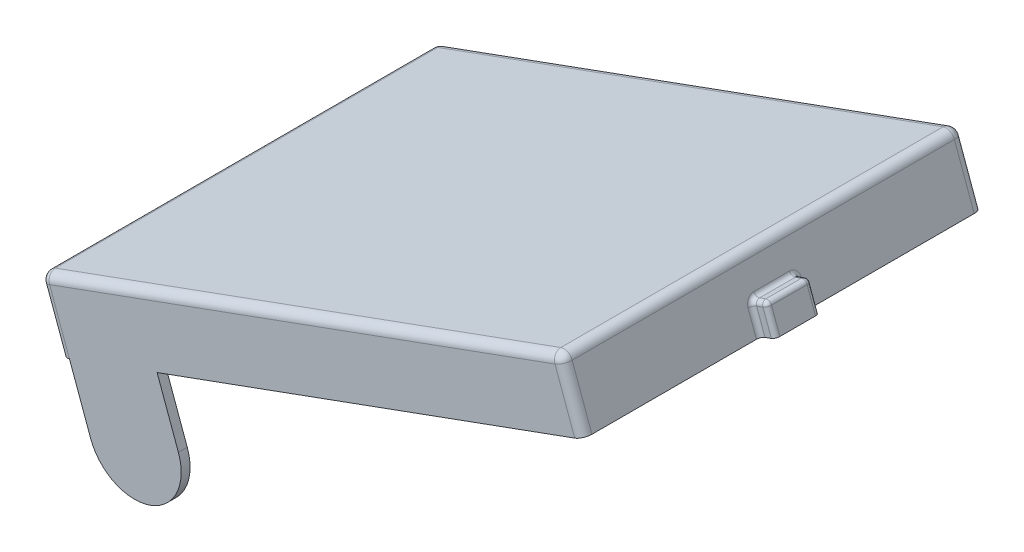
ISO-10303-21;
HEADER;
FILE_DESCRIPTION(('STEP AP214'),'2;1');
FILE_NAME('part.step','',(''),(''),'','','');
FILE_SCHEMA(('AUTOMOTIVE_DESIGN { 1 0 10303 214 1 1 1 1 }'));
ENDSEC;
DATA;
#1=APPLICATION_CONTEXT('core data for automotive mechanical design processes');
#2=APPLICATION_PROTOCOL_DEFINITION('international standard','automotive_design',2000,#1);
#3=PRODUCT_CONTEXT('',#1,'mechanical');
#4=PRODUCT('Part','Part','',(#3));
#5=PRODUCT_RELATED_PRODUCT_CATEGORY('part','',(#4));
#6=PRODUCT_DEFINITION_FORMATION('','',#4);
#7=PRODUCT_DEFINITION_CONTEXT('part definition',#1,'design');
#8=PRODUCT_DEFINITION('design','',#6,#7);
#9=PRODUCT_DEFINITION_SHAPE('','',#8);
#10=(LENGTH_UNIT() NAMED_UNIT(*) SI_UNIT(.MILLI.,.METRE.));
#11=(NAMED_UNIT(*) PLANE_ANGLE_UNIT() SI_UNIT($,.RADIAN.));
#12=(NAMED_UNIT(*) SI_UNIT($,.STERADIAN.) SOLID_ANGLE_UNIT());
#13=UNCERTAINTY_MEASURE_WITH_UNIT(LENGTH_MEASURE(1.E-05),#10,'distance_accuracy_value','');
#14=(GEOMETRIC_REPRESENTATION_CONTEXT(3) GLOBAL_UNCERTAINTY_ASSIGNED_CONTEXT((#13)) GLOBAL_UNIT_ASSIGNED_CONTEXT((#10,
#11,#12)) REPRESENTATION_CONTEXT('',''));
#15=CARTESIAN_POINT('',(0.,0.,0.));
#16=DIRECTION('',(0.,0.,1.));
#17=DIRECTION('',(1.,0.,0.));
#18=AXIS2_PLACEMENT_3D('',#15,#16,#17);
#19=CARTESIAN_POINT('',(45.7968356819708,81.7283521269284,45.));
#20=DIRECTION('',(-0.939692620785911,-0.342020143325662,0.));
#21=DIRECTION('',(0.,0.,1.));
#22=AXIS2_PLACEMENT_3D('',#19,#20,#21);
#23=PLANE('',#22);
#24=CARTESIAN_POINT('',(49.0460270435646,72.8012722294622,-3.99999999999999));
#25=DIRECTION('',(-0.939692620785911,-0.342020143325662,0.));
#26=DIRECTION('',(0.342020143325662,-0.939692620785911,0.));
#27=AXIS2_PLACEMENT_3D('',#24,#25,#26);
#28=CIRCLE('',#27,2.);
#29=CARTESIAN_POINT('',(49.0460270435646,72.8012722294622,-5.99999999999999));
#30=VERTEX_POINT('',#29);
#31=CARTESIAN_POINT('',(48.3619867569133,74.6806574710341,-3.99999999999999));
#32=VERTEX_POINT('',#31);
#33=EDGE_CURVE('E43',#30,#32,#28,.F.);
#34=ORIENTED_EDGE('',*,*,#33,.F.);
#35=DIRECTION('',(-0.342020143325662,0.939692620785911,0.));
#36=VECTOR('',#35,1.);
#37=CARTESIAN_POINT('',(50.9271378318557,67.6329628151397,-5.99999999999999));
#38=LINE('',#37,#36);
#39=CARTESIAN_POINT('',(50.9271378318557,67.6329628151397,-5.99999999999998));
#40=VERTEX_POINT('',#39);
#41=EDGE_CURVE('E354',#30,#40,#38,.F.);
#42=ORIENTED_EDGE('',*,*,#41,.T.);
#43=DIRECTION('',(0.,0.,-1.));
#44=VECTOR('',#43,1.);
#45=CARTESIAN_POINT('',(50.9271378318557,67.6329628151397,45.));
#46=LINE('',#45,#44);
#47=CARTESIAN_POINT('',(50.9271378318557,67.6329628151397,-43.));
#48=VERTEX_POINT('',#47);
#49=EDGE_CURVE('E364',#40,#48,#46,.T.);
#50=ORIENTED_EDGE('',*,*,#49,.T.);
#51=DIRECTION('',(0.342020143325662,-0.939692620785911,0.));
#52=VECTOR('',#51,1.);
#53=CARTESIAN_POINT('',(45.7968356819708,81.7283521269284,-43.));
#54=LINE('',#53,#52);
#55=CARTESIAN_POINT('',(46.4808759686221,79.8489668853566,-43.));
#56=VERTEX_POINT('',#55);
#57=EDGE_CURVE('E504',#48,#56,#54,.F.);
#58=ORIENTED_EDGE('',*,*,#57,.T.);
#59=DIRECTION('',(0.,0.,-1.));
#60=VECTOR('',#59,1.);
#61=CARTESIAN_POINT('',(46.4808759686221,79.8489668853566,43.));
#62=LINE('',#61,#60);
#63=CARTESIAN_POINT('',(46.4808759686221,79.8489668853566,43.));
#64=VERTEX_POINT('',#63);
#65=EDGE_CURVE('E482',#56,#64,#62,.F.);
#66=ORIENTED_EDGE('',*,*,#65,.T.);
#67=DIRECTION('',(0.342020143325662,-0.939692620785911,0.));
#68=VECTOR('',#67,1.);
#69=CARTESIAN_POINT('',(45.7968356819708,81.7283521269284,43.));
#70=LINE('',#69,#68);
#71=CARTESIAN_POINT('',(50.9271378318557,67.6329628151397,43.));
#72=VERTEX_POINT('',#71);
#73=EDGE_CURVE('E507',#64,#72,#70,.T.);
#74=ORIENTED_EDGE('',*,*,#73,.T.);
#75=CARTESIAN_POINT('',(50.9271378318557,67.6329628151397,6.00000000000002));
#76=VERTEX_POINT('',#75);
#77=EDGE_CURVE('E532',#72,#76,#46,.T.);
#78=ORIENTED_EDGE('',*,*,#77,.T.);
#79=DIRECTION('',(0.342020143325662,-0.939692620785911,0.));
#80=VECTOR('',#79,1.);
#81=CARTESIAN_POINT('',(48.7040069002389,73.7409648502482,6.00000000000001));
#82=LINE('',#81,#80);
#83=CARTESIAN_POINT('',(49.0460270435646,72.8012722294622,6.00000000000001));
#84=VERTEX_POINT('',#83);
#85=EDGE_CURVE('E350',#76,#84,#82,.F.);
#86=ORIENTED_EDGE('',*,*,#85,.T.);
#87=CARTESIAN_POINT('',(49.0460270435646,72.8012722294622,4.00000000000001));
#88=DIRECTION('',(-0.939692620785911,-0.342020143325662,0.));
#89=DIRECTION('',(0.342020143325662,-0.939692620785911,0.));
#90=AXIS2_PLACEMENT_3D('',#87,#88,#89);
#91=CIRCLE('',#90,2.);
#92=CARTESIAN_POINT('',(48.3619867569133,74.6806574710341,4.00000000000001));
#93=VERTEX_POINT('',#92);
#94=EDGE_CURVE('E347',#93,#84,#91,.F.);
#95=ORIENTED_EDGE('',*,*,#94,.F.);
#96=DIRECTION('',(0.,0.,1.));
#97=VECTOR('',#96,1.);
#98=CARTESIAN_POINT('',(48.3619867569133,74.6806574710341,-4.99999999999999));
#99=LINE('',#98,#97);
#100=EDGE_CURVE('E48',#93,#32,#99,.F.);
#101=ORIENTED_EDGE('',*,*,#100,.T.);
#102=EDGE_LOOP('',(#34,#42,#50,#58,#66,#74,#78,#86,#95,#101));
#103=FACE_BOUND('',#102,.T.);
#104=ADVANCED_FACE('F28',(#103),#23,.F.);
#105=CARTESIAN_POINT('',(50.9271378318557,67.6329628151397,-45.));
#106=DIRECTION('',(-0.342020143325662,0.939692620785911,0.));
#107=DIRECTION('',(0.,0.,1.));
#108=AXIS2_PLACEMENT_3D('',#105,#106,#107);
#109=PLANE('',#108);
#110=DIRECTION('',(0.,0.,-1.));
#111=VECTOR('',#110,1.);
#112=CARTESIAN_POINT('',(-64.6550545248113,25.5644851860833,-43.));
#113=LINE('',#112,#111);
#114=CARTESIAN_POINT('',(-64.6550545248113,25.5644851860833,-43.));
#115=VERTEX_POINT('',#114);
#116=CARTESIAN_POINT('',(-64.6550545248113,25.5644851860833,-45.));
#117=VERTEX_POINT('',#116);
#118=EDGE_CURVE('E269',#115,#117,#113,.T.);
#119=ORIENTED_EDGE('',*,*,#118,.F.);
#120=DIRECTION('',(0.,0.,1.));
#121=VECTOR('',#120,1.);
#122=CARTESIAN_POINT('',(-64.6550545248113,25.5644851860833,45.));
#123=LINE('',#122,#121);
#124=CARTESIAN_POINT('',(-64.6550545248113,25.5644851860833,43.));
#125=VERTEX_POINT('',#124);
#126=EDGE_CURVE('E457',#115,#125,#123,.T.);
#127=ORIENTED_EDGE('',*,*,#126,.T.);
#128=DIRECTION('',(0.,0.,1.));
#129=VECTOR('',#128,1.);
#130=CARTESIAN_POINT('',(-64.6550545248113,25.5644851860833,43.));
#131=LINE('',#130,#129);
#132=CARTESIAN_POINT('',(-64.6550545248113,25.5644851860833,45.));
#133=VERTEX_POINT('',#132);
#134=EDGE_CURVE('E307',#125,#133,#131,.T.);
#135=ORIENTED_EDGE('',*,*,#134,.T.);
#136=CARTESIAN_POINT('',(-64.6550545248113,25.5644851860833,43.));
#137=DIRECTION('',(-0.342020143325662,0.939692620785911,0.));
#138=DIRECTION('',(0.,0.,1.));
#139=AXIS2_PLACEMENT_3D('',#136,#137,#138);
#140=CIRCLE('',#139,2.);
#141=CARTESIAN_POINT('',(-66.5344397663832,24.880444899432,43.));
#142=VERTEX_POINT('',#141);
#143=EDGE_CURVE('E520',#133,#142,#140,.F.);
#144=ORIENTED_EDGE('',*,*,#143,.T.);
#145=DIRECTION('',(0.,0.,1.));
#146=VECTOR('',#145,1.);
#147=CARTESIAN_POINT('',(-66.5344397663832,24.880444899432,45.));
#148=LINE('',#147,#146);
#149=CARTESIAN_POINT('',(-66.5344397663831,24.880444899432,-43.));
#150=VERTEX_POINT('',#149);
#151=EDGE_CURVE('E536',#150,#142,#148,.T.);
#152=ORIENTED_EDGE('',*,*,#151,.F.);
#153=CARTESIAN_POINT('',(-64.6550545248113,25.5644851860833,-43.));
#154=DIRECTION('',(-0.342020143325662,0.939692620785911,0.));
#155=DIRECTION('',(0.,0.,1.));
#156=AXIS2_PLACEMENT_3D('',#153,#154,#155);
#157=CIRCLE('',#156,2.);
#158=EDGE_CURVE('E460',#150,#117,#157,.F.);
#159=ORIENTED_EDGE('',*,*,#158,.T.);
#160=EDGE_LOOP('',(#119,#127,#135,#144,#152,#159));
#161=FACE_BOUND('',#160,.T.);
#162=ADVANCED_FACE('F455',(#161),#109,.F.);
#163=DIRECTION('',(-0.939692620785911,-0.342020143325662,0.));
#164=VECTOR('',#163,1.);
#165=CARTESIAN_POINT('',(54.2160620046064,68.8300333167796,-4.99999999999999));
#166=LINE('',#165,#164);
#167=CARTESIAN_POINT('',(53.2763693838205,68.4880131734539,-4.99999999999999));
#168=VERTEX_POINT('',#167);
#169=CARTESIAN_POINT('',(51.8668304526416,67.9749829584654,-4.99999999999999));
#170=VERTEX_POINT('',#169);
#171=EDGE_CURVE('E361',#168,#170,#166,.T.);
#172=ORIENTED_EDGE('',*,*,#171,.F.);
#173=CARTESIAN_POINT('',(53.2763693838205,68.4880131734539,-3.99999999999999));
#174=DIRECTION('',(-0.342020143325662,0.939692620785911,0.));
#175=DIRECTION('',(-0.939692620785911,-0.342020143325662,0.));
#176=AXIS2_PLACEMENT_3D('',#173,#174,#175);
#177=CIRCLE('',#176,1.);
#178=CARTESIAN_POINT('',(54.2160620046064,68.8300333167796,-3.99999999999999));
#179=VERTEX_POINT('',#178);
#180=EDGE_CURVE('E330',#168,#179,#177,.F.);
#181=ORIENTED_EDGE('',*,*,#180,.T.);
#182=DIRECTION('',(0.,0.,-1.));
#183=VECTOR('',#182,1.);
#184=CARTESIAN_POINT('',(54.2160620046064,68.8300333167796,5.00000000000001));
#185=LINE('',#184,#183);
#186=CARTESIAN_POINT('',(54.2160620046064,68.8300333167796,4.00000000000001));
#187=VERTEX_POINT('',#186);
#188=EDGE_CURVE('E372',#187,#179,#185,.T.);
#189=ORIENTED_EDGE('',*,*,#188,.F.);
#190=CARTESIAN_POINT('',(53.2763693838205,68.4880131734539,4.00000000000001));
#191=DIRECTION('',(-0.342020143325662,0.939692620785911,0.));
#192=DIRECTION('',(-0.939692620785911,-0.342020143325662,0.));
#193=AXIS2_PLACEMENT_3D('',#190,#191,#192);
#194=CIRCLE('',#193,1.);
#195=CARTESIAN_POINT('',(53.2763693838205,68.4880131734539,5.00000000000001));
#196=VERTEX_POINT('',#195);
#197=EDGE_CURVE('E328',#187,#196,#194,.F.);
#198=ORIENTED_EDGE('',*,*,#197,.T.);
#199=DIRECTION('',(-0.939692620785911,-0.342020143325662,0.));
#200=VECTOR('',#199,1.);
#201=CARTESIAN_POINT('',(54.2160620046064,68.8300333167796,5.00000000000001));
#202=LINE('',#201,#200);
#203=CARTESIAN_POINT('',(51.8668304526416,67.9749829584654,5.00000000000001));
#204=VERTEX_POINT('',#203);
#205=EDGE_CURVE('E371',#196,#204,#202,.T.);
#206=ORIENTED_EDGE('',*,*,#205,.T.);
#207=CARTESIAN_POINT('',(51.8668304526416,67.9749829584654,6.00000000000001));
#208=DIRECTION('',(-0.342020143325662,0.939692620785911,0.));
#209=DIRECTION('',(-0.939692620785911,-0.342020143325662,0.));
#210=AXIS2_PLACEMENT_3D('',#207,#208,#209);
#211=CIRCLE('',#210,1.);
#212=EDGE_CURVE('E11',#204,#76,#211,.T.);
#213=ORIENTED_EDGE('',*,*,#212,.T.);
#214=ORIENTED_EDGE('',*,*,#77,.F.);
#215=CARTESIAN_POINT('',(49.0477525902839,66.9489225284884,43.));
#216=DIRECTION('',(-0.342020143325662,0.939692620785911,0.));
#217=DIRECTION('',(0.,0.,1.));
#218=AXIS2_PLACEMENT_3D('',#215,#216,#217);
#219=CIRCLE('',#218,2.);
#220=CARTESIAN_POINT('',(49.0477525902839,66.9489225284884,45.));
#221=VERTEX_POINT('',#220);
#222=EDGE_CURVE('E524',#72,#221,#219,.F.);
#223=ORIENTED_EDGE('',*,*,#222,.T.);
#224=DIRECTION('',(0.939692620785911,0.342020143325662,0.));
#225=VECTOR('',#224,1.);
#226=CARTESIAN_POINT('',(-66.5344397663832,24.880444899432,45.));
#227=LINE('',#226,#225);
#228=CARTESIAN_POINT('',(-44.9215094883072,32.7469081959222,45.));
#229=VERTEX_POINT('',#228);
#230=EDGE_CURVE('E303',#229,#221,#227,.T.);
#231=ORIENTED_EDGE('',*,*,#230,.F.);
#232=DIRECTION('',(0.,0.,1.));
#233=VECTOR('',#232,1.);
#234=CARTESIAN_POINT('',(-44.9215094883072,32.7469081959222,43.));
#235=LINE('',#234,#233);
#236=CARTESIAN_POINT('',(-44.9215094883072,32.7469081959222,43.));
#237=VERTEX_POINT('',#236);
#238=EDGE_CURVE('E299',#237,#229,#235,.T.);
#239=ORIENTED_EDGE('',*,*,#238,.F.);
#240=DIRECTION('',(0.939692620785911,0.342020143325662,0.));
#241=VECTOR('',#240,1.);
#242=CARTESIAN_POINT('',(-66.5344397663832,24.880444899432,43.));
#243=LINE('',#242,#241);
#244=CARTESIAN_POINT('',(49.0477525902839,66.9489225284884,43.));
#245=VERTEX_POINT('',#244);
#246=EDGE_CURVE('E469',#237,#245,#243,.T.);
#247=ORIENTED_EDGE('',*,*,#246,.T.);
#248=DIRECTION('',(0.,0.,-1.));
#249=VECTOR('',#248,1.);
#250=CARTESIAN_POINT('',(49.0477525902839,66.9489225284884,45.));
#251=LINE('',#250,#249);
#252=CARTESIAN_POINT('',(49.0477525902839,66.9489225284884,-43.));
#253=VERTEX_POINT('',#252);
#254=EDGE_CURVE('E467',#245,#253,#251,.T.);
#255=ORIENTED_EDGE('',*,*,#254,.T.);
#256=DIRECTION('',(-0.939692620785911,-0.342020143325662,0.));
#257=VECTOR('',#256,1.);
#258=CARTESIAN_POINT('',(-66.5344397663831,24.880444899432,-43.));
#259=LINE('',#258,#257);
#260=CARTESIAN_POINT('',(-44.9215094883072,32.7469081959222,-43.));
#261=VERTEX_POINT('',#260);
#262=EDGE_CURVE('E302',#253,#261,#259,.T.);
#263=ORIENTED_EDGE('',*,*,#262,.T.);
#264=DIRECTION('',(0.,0.,-1.));
#265=VECTOR('',#264,1.);
#266=CARTESIAN_POINT('',(-44.9215094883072,32.7469081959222,-43.));
#267=LINE('',#266,#265);
#268=CARTESIAN_POINT('',(-44.9215094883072,32.7469081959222,-45.));
#269=VERTEX_POINT('',#268);
#270=EDGE_CURVE('E250',#261,#269,#267,.T.);
#271=ORIENTED_EDGE('',*,*,#270,.T.);
#272=DIRECTION('',(-0.939692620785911,-0.342020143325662,0.));
#273=VECTOR('',#272,1.);
#274=CARTESIAN_POINT('',(-66.5344397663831,24.880444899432,-45.));
#275=LINE('',#274,#273);
#276=CARTESIAN_POINT('',(49.0477525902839,66.9489225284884,-45.));
#277=VERTEX_POINT('',#276);
#278=EDGE_CURVE('E255',#277,#269,#275,.T.);
#279=ORIENTED_EDGE('',*,*,#278,.F.);
#280=CARTESIAN_POINT('',(49.0477525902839,66.9489225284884,-43.));
#281=DIRECTION('',(-0.342020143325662,0.939692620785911,0.));
#282=DIRECTION('',(0.,0.,1.));
#283=AXIS2_PLACEMENT_3D('',#280,#281,#282);
#284=CIRCLE('',#283,2.);
#285=EDGE_CURVE('E522',#277,#48,#284,.F.);
#286=ORIENTED_EDGE('',*,*,#285,.T.);
#287=ORIENTED_EDGE('',*,*,#49,.F.);
#288=CARTESIAN_POINT('',(51.8668304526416,67.9749829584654,-5.99999999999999));
#289=DIRECTION('',(-0.342020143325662,0.939692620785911,0.));
#290=DIRECTION('',(-0.939692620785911,-0.342020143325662,0.));
#291=AXIS2_PLACEMENT_3D('',#288,#289,#290);
#292=CIRCLE('',#291,1.);
#293=EDGE_CURVE('E36',#40,#170,#292,.T.);
#294=ORIENTED_EDGE('',*,*,#293,.T.);
#295=EDGE_LOOP('',(#172,#181,#189,#198,#206,#213,#214,#223,#231,#239,#247,#255,#263,#271,#279,
#286,#287,#294));
#296=FACE_BOUND('',#295,.T.);
#297=ADVANCED_FACE('F360',(#296),#109,.F.);
#298=CARTESIAN_POINT('',(-71.6647419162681,38.9758342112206,-45.));
#299=DIRECTION('',(0.,0.,1.));
#300=DIRECTION('',(0.939692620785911,0.342020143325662,0.));
#301=AXIS2_PLACEMENT_3D('',#298,#299,#300);
#302=PLANE('',#301);
#303=DIRECTION('',(0.342020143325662,-0.939692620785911,0.));
#304=VECTOR('',#303,1.);
#305=CARTESIAN_POINT('',(-69.7853566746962,39.659874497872,-45.));
#306=LINE('',#305,#304);
#307=CARTESIAN_POINT('',(-69.1013163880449,37.7804892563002,-45.));
#308=VERTEX_POINT('',#307);
#309=EDGE_CURVE('E515',#117,#308,#306,.F.);
#310=ORIENTED_EDGE('',*,*,#309,.T.);
#311=DIRECTION('',(-0.939692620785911,-0.342020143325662,0.));
#312=VECTOR('',#311,1.);
#313=CARTESIAN_POINT('',(44.6014907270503,79.1649265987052,-45.));
#314=LINE('',#313,#312);
#315=CARTESIAN_POINT('',(44.6014907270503,79.1649265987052,-45.));
#316=VERTEX_POINT('',#315);
#317=EDGE_CURVE('E486',#308,#316,#314,.F.);
#318=ORIENTED_EDGE('',*,*,#317,.T.);
#319=DIRECTION('',(0.342020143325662,-0.939692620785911,0.));
#320=VECTOR('',#319,1.);
#321=CARTESIAN_POINT('',(43.917450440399,81.0443118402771,-45.));
#322=LINE('',#321,#320);
#323=EDGE_CURVE('E517',#316,#277,#322,.T.);
#324=ORIENTED_EDGE('',*,*,#323,.T.);
#325=ORIENTED_EDGE('',*,*,#278,.T.);
#326=DIRECTION('',(-0.342020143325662,0.939692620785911,0.));
#327=VECTOR('',#326,1.);
#328=CARTESIAN_POINT('',(-40.1332274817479,19.5912115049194,-45.));
#329=LINE('',#328,#327);
#330=CARTESIAN_POINT('',(-40.1332274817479,19.5912115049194,-45.));
#331=VERTEX_POINT('',#330);
#332=EDGE_CURVE('E242',#331,#269,#329,.T.);
#333=ORIENTED_EDGE('',*,*,#332,.F.);
#334=CARTESIAN_POINT('',(-50.,16.,-45.));
#335=DIRECTION('',(0.,0.,1.));
#336=DIRECTION('',(0.939692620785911,0.342020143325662,0.));
#337=AXIS2_PLACEMENT_3D('',#334,#335,#336);
#338=CIRCLE('',#337,10.5);
#339=CARTESIAN_POINT('',(-59.8667725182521,12.4087884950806,-45.));
#340=VERTEX_POINT('',#339);
#341=EDGE_CURVE('E230',#340,#331,#338,.T.);
#342=ORIENTED_EDGE('',*,*,#341,.F.);
#343=DIRECTION('',(0.342020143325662,-0.939692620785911,0.));
#344=VECTOR('',#343,1.);
#345=CARTESIAN_POINT('',(-64.6550545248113,25.5644851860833,-45.));
#346=LINE('',#345,#344);
#347=EDGE_CURVE('E241',#117,#340,#346,.T.);
#348=ORIENTED_EDGE('',*,*,#347,.F.);
#349=EDGE_LOOP('',(#310,#318,#324,#325,#333,#342,#348));
#350=FACE_BOUND('',#349,.T.);
#351=ADVANCED_FACE('F30',(#350),#302,.F.);
#352=CARTESIAN_POINT('',(-71.6647419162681,38.9758342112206,45.));
#353=DIRECTION('',(0.939692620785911,0.342020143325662,0.));
#354=DIRECTION('',(0.,0.,-1.));
#355=AXIS2_PLACEMENT_3D('',#352,#353,#354);
#356=PLANE('',#355);
#357=DIRECTION('',(0.342020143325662,-0.939692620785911,0.));
#358=VECTOR('',#357,1.);
#359=CARTESIAN_POINT('',(-71.6647419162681,38.9758342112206,43.));
#360=LINE('',#359,#358);
#361=CARTESIAN_POINT('',(-70.9807016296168,37.0964489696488,43.));
#362=VERTEX_POINT('',#361);
#363=EDGE_CURVE('E529',#142,#362,#360,.F.);
#364=ORIENTED_EDGE('',*,*,#363,.T.);
#365=DIRECTION('',(0.,0.,1.));
#366=VECTOR('',#365,1.);
#367=CARTESIAN_POINT('',(-70.9807016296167,37.0964489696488,-43.));
#368=LINE('',#367,#366);
#369=CARTESIAN_POINT('',(-70.9807016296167,37.0964489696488,-43.));
#370=VERTEX_POINT('',#369);
#371=EDGE_CURVE('E490',#362,#370,#368,.F.);
#372=ORIENTED_EDGE('',*,*,#371,.T.);
#373=DIRECTION('',(0.342020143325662,-0.939692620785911,0.));
#374=VECTOR('',#373,1.);
#375=CARTESIAN_POINT('',(-71.6647419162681,38.9758342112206,-43.));
#376=LINE('',#375,#374);
#377=EDGE_CURVE('E527',#370,#150,#376,.T.);
#378=ORIENTED_EDGE('',*,*,#377,.T.);
#379=ORIENTED_EDGE('',*,*,#151,.T.);
#380=EDGE_LOOP('',(#364,#372,#378,#379));
#381=FACE_BOUND('',#380,.T.);
#382=ADVANCED_FACE('F691',(#381),#356,.F.);
#383=CARTESIAN_POINT('',(-71.6647419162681,38.9758342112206,45.));
#384=DIRECTION('',(0.,0.,-1.));
#385=DIRECTION('',(-0.939692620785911,-0.342020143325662,0.));
#386=AXIS2_PLACEMENT_3D('',#383,#384,#385);
#387=PLANE('',#386);
#388=DIRECTION('',(0.342020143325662,-0.939692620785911,0.));
#389=VECTOR('',#388,1.);
#390=CARTESIAN_POINT('',(43.917450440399,81.044311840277,45.));
#391=LINE('',#390,#389);
#392=CARTESIAN_POINT('',(44.6014907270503,79.1649265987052,45.));
#393=VERTEX_POINT('',#392);
#394=EDGE_CURVE('E512',#221,#393,#391,.F.);
#395=ORIENTED_EDGE('',*,*,#394,.T.);
#396=DIRECTION('',(0.939692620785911,0.342020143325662,0.));
#397=VECTOR('',#396,1.);
#398=CARTESIAN_POINT('',(-69.1013163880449,37.7804892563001,45.));
#399=LINE('',#398,#397);
#400=CARTESIAN_POINT('',(-69.1013163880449,37.7804892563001,45.));
#401=VERTEX_POINT('',#400);
#402=EDGE_CURVE('E317',#393,#401,#399,.F.);
#403=ORIENTED_EDGE('',*,*,#402,.T.);
#404=DIRECTION('',(0.342020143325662,-0.939692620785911,0.));
#405=VECTOR('',#404,1.);
#406=CARTESIAN_POINT('',(-69.7853566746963,39.659874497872,45.));
#407=LINE('',#406,#405);
#408=EDGE_CURVE('E509',#401,#133,#407,.T.);
#409=ORIENTED_EDGE('',*,*,#408,.T.);
#410=DIRECTION('',(0.342020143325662,-0.939692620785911,0.));
#411=VECTOR('',#410,1.);
#412=CARTESIAN_POINT('',(-64.6550545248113,25.5644851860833,45.));
#413=LINE('',#412,#411);
#414=CARTESIAN_POINT('',(-59.8667725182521,12.4087884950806,45.));
#415=VERTEX_POINT('',#414);
#416=EDGE_CURVE('E280',#133,#415,#413,.T.);
#417=ORIENTED_EDGE('',*,*,#416,.T.);
#418=CARTESIAN_POINT('',(-50.,16.,45.));
#419=DIRECTION('',(0.,0.,1.));
#420=DIRECTION('',(0.939692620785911,0.342020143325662,0.));
#421=AXIS2_PLACEMENT_3D('',#418,#419,#420);
#422=CIRCLE('',#421,10.5);
#423=CARTESIAN_POINT('',(-40.1332274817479,19.5912115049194,45.));
#424=VERTEX_POINT('',#423);
#425=EDGE_CURVE('E283',#415,#424,#422,.T.);
#426=ORIENTED_EDGE('',*,*,#425,.T.);
#427=DIRECTION('',(-0.342020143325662,0.939692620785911,0.));
#428=VECTOR('',#427,1.);
#429=CARTESIAN_POINT('',(-40.1332274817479,19.5912115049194,45.));
#430=LINE('',#429,#428);
#431=EDGE_CURVE('E286',#424,#229,#430,.T.);
#432=ORIENTED_EDGE('',*,*,#431,.T.);
#433=ORIENTED_EDGE('',*,*,#230,.T.);
#434=EDGE_LOOP('',(#395,#403,#409,#417,#426,#432,#433));
#435=FACE_BOUND('',#434,.T.);
#436=ADVANCED_FACE('F597',(#435),#387,.F.);
#437=CARTESIAN_POINT('',(45.7968356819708,81.7283521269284,-45.));
#438=DIRECTION('',(-0.342020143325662,0.939692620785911,0.));
#439=DIRECTION('',(0.,0.,1.));
#440=AXIS2_PLACEMENT_3D('',#437,#438,#439);
#441=PLANE('',#440);
#442=DIRECTION('',(-0.939692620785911,-0.342020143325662,0.));
#443=VECTOR('',#442,1.);
#444=CARTESIAN_POINT('',(-69.7853566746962,39.659874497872,-43.));
#445=LINE('',#444,#443);
#446=CARTESIAN_POINT('',(43.917450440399,81.0443118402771,-43.));
#447=VERTEX_POINT('',#446);
#448=CARTESIAN_POINT('',(-69.7853566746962,39.659874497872,-43.));
#449=VERTEX_POINT('',#448);
#450=EDGE_CURVE('E495',#447,#449,#445,.T.);
#451=ORIENTED_EDGE('',*,*,#450,.T.);
#452=DIRECTION('',(0.,0.,1.));
#453=VECTOR('',#452,1.);
#454=CARTESIAN_POINT('',(-69.7853566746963,39.659874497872,43.));
#455=LINE('',#454,#453);
#456=CARTESIAN_POINT('',(-69.7853566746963,39.659874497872,43.));
#457=VERTEX_POINT('',#456);
#458=EDGE_CURVE('E492',#449,#457,#455,.T.);
#459=ORIENTED_EDGE('',*,*,#458,.T.);
#460=DIRECTION('',(0.939692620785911,0.342020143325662,0.));
#461=VECTOR('',#460,1.);
#462=CARTESIAN_POINT('',(43.917450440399,81.044311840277,43.));
#463=LINE('',#462,#461);
#464=CARTESIAN_POINT('',(43.917450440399,81.044311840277,43.));
#465=VERTEX_POINT('',#464);
#466=EDGE_CURVE('E499',#457,#465,#463,.T.);
#467=ORIENTED_EDGE('',*,*,#466,.T.);
#468=DIRECTION('',(0.,0.,-1.));
#469=VECTOR('',#468,1.);
#470=CARTESIAN_POINT('',(43.917450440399,81.0443118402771,-43.));
#471=LINE('',#470,#469);
#472=EDGE_CURVE('E497',#465,#447,#471,.T.);
#473=ORIENTED_EDGE('',*,*,#472,.T.);
#474=EDGE_LOOP('',(#451,#459,#467,#473));
#475=FACE_BOUND('',#474,.T.);
#476=ADVANCED_FACE('F623',(#475),#441,.T.);
#477=CARTESIAN_POINT('',(-69.7853566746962,39.659874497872,-43.));
#478=DIRECTION('',(0.342020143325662,-0.939692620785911,0.));
#479=DIRECTION('',(0.,0.,-1.));
#480=AXIS2_PLACEMENT_3D('',#477,#478,#479);
#481=CYLINDRICAL_SURFACE('',#480,2.);
#482=ORIENTED_EDGE('',*,*,#377,.F.);
#483=CARTESIAN_POINT('',(-69.1013163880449,37.7804892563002,-43.));
#484=DIRECTION('',(0.342020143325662,-0.939692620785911,0.));
#485=DIRECTION('',(0.,0.,-1.));
#486=AXIS2_PLACEMENT_3D('',#483,#484,#485);
#487=CIRCLE('',#486,2.);
#488=EDGE_CURVE('E488',#370,#308,#487,.T.);
#489=ORIENTED_EDGE('',*,*,#488,.T.);
#490=ORIENTED_EDGE('',*,*,#309,.F.);
#491=ORIENTED_EDGE('',*,*,#158,.F.);
#492=EDGE_LOOP('',(#482,#489,#490,#491));
#493=FACE_BOUND('',#492,.T.);
#494=ADVANCED_FACE('F739',(#493),#481,.T.);
#495=CARTESIAN_POINT('',(-69.7853566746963,39.659874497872,43.));
#496=DIRECTION('',(0.342020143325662,-0.939692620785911,0.));
#497=DIRECTION('',(0.,0.,-1.));
#498=AXIS2_PLACEMENT_3D('',#495,#496,#497);
#499=CYLINDRICAL_SURFACE('',#498,2.);
#500=ORIENTED_EDGE('',*,*,#408,.F.);
#501=CARTESIAN_POINT('',(-69.1013163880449,37.7804892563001,43.));
#502=DIRECTION('',(0.342020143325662,-0.939692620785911,0.));
#503=DIRECTION('',(0.,0.,-1.));
#504=AXIS2_PLACEMENT_3D('',#501,#502,#503);
#505=CIRCLE('',#504,2.);
#506=EDGE_CURVE('E501',#401,#362,#505,.T.);
#507=ORIENTED_EDGE('',*,*,#506,.T.);
#508=ORIENTED_EDGE('',*,*,#363,.F.);
#509=ORIENTED_EDGE('',*,*,#143,.F.);
#510=EDGE_LOOP('',(#500,#507,#508,#509));
#511=FACE_BOUND('',#510,.T.);
#512=ADVANCED_FACE('F705',(#511),#499,.T.);
#513=CARTESIAN_POINT('',(43.917450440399,81.0443118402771,-43.));
#514=DIRECTION('',(0.342020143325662,-0.939692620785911,0.));
#515=DIRECTION('',(0.,0.,-1.));
#516=AXIS2_PLACEMENT_3D('',#513,#514,#515);
#517=CYLINDRICAL_SURFACE('',#516,2.);
#518=ORIENTED_EDGE('',*,*,#323,.F.);
#519=CARTESIAN_POINT('',(44.6014907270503,79.1649265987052,-43.));
#520=DIRECTION('',(0.342020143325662,-0.939692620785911,0.));
#521=DIRECTION('',(0.,0.,-1.));
#522=AXIS2_PLACEMENT_3D('',#519,#520,#521);
#523=CIRCLE('',#522,2.);
#524=EDGE_CURVE('E484',#316,#56,#523,.T.);
#525=ORIENTED_EDGE('',*,*,#524,.T.);
#526=ORIENTED_EDGE('',*,*,#57,.F.);
#527=ORIENTED_EDGE('',*,*,#285,.F.);
#528=EDGE_LOOP('',(#518,#525,#526,#527));
#529=FACE_BOUND('',#528,.T.);
#530=ADVANCED_FACE('F610',(#529),#517,.T.);
#531=CARTESIAN_POINT('',(43.917450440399,81.044311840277,43.));
#532=DIRECTION('',(0.342020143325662,-0.939692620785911,0.));
#533=DIRECTION('',(0.,0.,-1.));
#534=AXIS2_PLACEMENT_3D('',#531,#532,#533);
#535=CYLINDRICAL_SURFACE('',#534,2.);
#536=ORIENTED_EDGE('',*,*,#73,.F.);
#537=CARTESIAN_POINT('',(44.6014907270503,79.1649265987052,43.));
#538=DIRECTION('',(0.342020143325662,-0.939692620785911,0.));
#539=DIRECTION('',(0.,0.,-1.));
#540=AXIS2_PLACEMENT_3D('',#537,#538,#539);
#541=CIRCLE('',#540,2.);
#542=EDGE_CURVE('E480',#64,#393,#541,.T.);
#543=ORIENTED_EDGE('',*,*,#542,.T.);
#544=ORIENTED_EDGE('',*,*,#394,.F.);
#545=ORIENTED_EDGE('',*,*,#222,.F.);
#546=EDGE_LOOP('',(#536,#543,#544,#545));
#547=FACE_BOUND('',#546,.T.);
#548=ADVANCED_FACE('F633',(#547),#535,.T.);
#549=CARTESIAN_POINT('',(44.6014907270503,79.1649265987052,-43.));
#550=DIRECTION('',(0.,0.,1.));
#551=DIRECTION('',(0.939692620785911,0.342020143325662,0.));
#552=AXIS2_PLACEMENT_3D('',#549,#550,#551);
#553=SPHERICAL_SURFACE('',#552,2.);
#554=CARTESIAN_POINT('',(44.6014907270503,79.1649265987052,-43.));
#555=DIRECTION('',(0.,0.,1.));
#556=DIRECTION('',(0.939692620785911,0.342020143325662,0.));
#557=AXIS2_PLACEMENT_3D('',#554,#555,#556);
#558=CIRCLE('',#557,2.);
#559=EDGE_CURVE('E543',#56,#447,#558,.T.);
#560=ORIENTED_EDGE('',*,*,#559,.F.);
#561=ORIENTED_EDGE('',*,*,#524,.F.);
#562=CARTESIAN_POINT('',(44.6014907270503,79.1649265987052,-43.));
#563=DIRECTION('',(-0.939692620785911,-0.342020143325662,0.));
#564=DIRECTION('',(0.,0.,1.));
#565=AXIS2_PLACEMENT_3D('',#562,#563,#564);
#566=CIRCLE('',#565,2.);
#567=EDGE_CURVE('E540',#447,#316,#566,.T.);
#568=ORIENTED_EDGE('',*,*,#567,.F.);
#569=EDGE_LOOP('',(#560,#561,#568));
#570=FACE_BOUND('',#569,.T.);
#571=ADVANCED_FACE('F614',(#570),#553,.T.);
#572=CARTESIAN_POINT('',(46.4808759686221,79.8489668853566,-43.));
#573=DIRECTION('',(0.939692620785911,0.342020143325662,0.));
#574=DIRECTION('',(0.,0.,-1.));
#575=AXIS2_PLACEMENT_3D('',#572,#573,#574);
#576=CYLINDRICAL_SURFACE('',#575,2.);
#577=ORIENTED_EDGE('',*,*,#567,.T.);
#578=ORIENTED_EDGE('',*,*,#317,.F.);
#579=CARTESIAN_POINT('',(-69.1013163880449,37.7804892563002,-43.));
#580=DIRECTION('',(-0.939692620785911,-0.342020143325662,0.));
#581=DIRECTION('',(0.,0.,1.));
#582=AXIS2_PLACEMENT_3D('',#579,#580,#581);
#583=CIRCLE('',#582,2.);
#584=EDGE_CURVE('E546',#449,#308,#583,.T.);
#585=ORIENTED_EDGE('',*,*,#584,.F.);
#586=ORIENTED_EDGE('',*,*,#450,.F.);
#587=EDGE_LOOP('',(#577,#578,#585,#586));
#588=FACE_BOUND('',#587,.T.);
#589=ADVANCED_FACE('F619',(#588),#576,.T.);
#590=CARTESIAN_POINT('',(44.6014907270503,79.1649265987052,-45.));
#591=DIRECTION('',(0.,0.,1.));
#592=DIRECTION('',(0.939692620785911,0.342020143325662,0.));
#593=AXIS2_PLACEMENT_3D('',#590,#591,#592);
#594=CYLINDRICAL_SURFACE('',#593,2.);
#595=ORIENTED_EDGE('',*,*,#559,.T.);
#596=ORIENTED_EDGE('',*,*,#472,.F.);
#597=CARTESIAN_POINT('',(44.6014907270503,79.1649265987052,43.));
#598=DIRECTION('',(0.,0.,1.));
#599=DIRECTION('',(0.939692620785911,0.342020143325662,0.));
#600=AXIS2_PLACEMENT_3D('',#597,#598,#599);
#601=CIRCLE('',#600,2.);
#602=EDGE_CURVE('E549',#64,#465,#601,.T.);
#603=ORIENTED_EDGE('',*,*,#602,.F.);
#604=ORIENTED_EDGE('',*,*,#65,.F.);
#605=EDGE_LOOP('',(#595,#596,#603,#604));
#606=FACE_BOUND('',#605,.T.);
#607=ADVANCED_FACE('F629',(#606),#594,.T.);
#608=CARTESIAN_POINT('',(-69.1013163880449,37.7804892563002,-43.));
#609=DIRECTION('',(0.,0.,1.));
#610=DIRECTION('',(0.939692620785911,0.342020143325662,0.));
#611=AXIS2_PLACEMENT_3D('',#608,#609,#610);
#612=SPHERICAL_SURFACE('',#611,2.);
#613=ORIENTED_EDGE('',*,*,#584,.T.);
#614=ORIENTED_EDGE('',*,*,#488,.F.);
#615=CARTESIAN_POINT('',(-69.1013163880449,37.7804892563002,-43.));
#616=DIRECTION('',(0.,0.,1.));
#617=DIRECTION('',(0.939692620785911,0.342020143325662,0.));
#618=AXIS2_PLACEMENT_3D('',#615,#616,#617);
#619=CIRCLE('',#618,2.);
#620=EDGE_CURVE('E552',#449,#370,#619,.T.);
#621=ORIENTED_EDGE('',*,*,#620,.F.);
#622=EDGE_LOOP('',(#613,#614,#621));
#623=FACE_BOUND('',#622,.T.);
#624=ADVANCED_FACE('F714',(#623),#612,.T.);
#625=CARTESIAN_POINT('',(44.6014907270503,79.1649265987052,43.));
#626=DIRECTION('',(0.,0.,1.));
#627=DIRECTION('',(0.939692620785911,0.342020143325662,0.));
#628=AXIS2_PLACEMENT_3D('',#625,#626,#627);
#629=SPHERICAL_SURFACE('',#628,2.);
#630=ORIENTED_EDGE('',*,*,#542,.F.);
#631=ORIENTED_EDGE('',*,*,#602,.T.);
#632=CARTESIAN_POINT('',(44.6014907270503,79.1649265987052,43.));
#633=DIRECTION('',(-0.939692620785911,-0.342020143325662,0.));
#634=DIRECTION('',(0.,0.,1.));
#635=AXIS2_PLACEMENT_3D('',#632,#633,#634);
#636=CIRCLE('',#635,2.);
#637=EDGE_CURVE('E555',#393,#465,#636,.T.);
#638=ORIENTED_EDGE('',*,*,#637,.F.);
#639=EDGE_LOOP('',(#630,#631,#638));
#640=FACE_BOUND('',#639,.T.);
#641=ADVANCED_FACE('F711',(#640),#629,.T.);
#642=CARTESIAN_POINT('',(-69.1013163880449,37.7804892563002,-45.));
#643=DIRECTION('',(0.,0.,-1.));
#644=DIRECTION('',(-0.939692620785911,-0.342020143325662,0.));
#645=AXIS2_PLACEMENT_3D('',#642,#643,#644);
#646=CYLINDRICAL_SURFACE('',#645,2.);
#647=ORIENTED_EDGE('',*,*,#620,.T.);
#648=ORIENTED_EDGE('',*,*,#371,.F.);
#649=CARTESIAN_POINT('',(-69.1013163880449,37.7804892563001,43.));
#650=DIRECTION('',(0.,0.,1.));
#651=DIRECTION('',(0.939692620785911,0.342020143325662,0.));
#652=AXIS2_PLACEMENT_3D('',#649,#650,#651);
#653=CIRCLE('',#652,2.);
#654=EDGE_CURVE('E558',#457,#362,#653,.T.);
#655=ORIENTED_EDGE('',*,*,#654,.F.);
#656=ORIENTED_EDGE('',*,*,#458,.F.);
#657=EDGE_LOOP('',(#647,#648,#655,#656));
#658=FACE_BOUND('',#657,.T.);
#659=ADVANCED_FACE('F713',(#658),#646,.T.);
#660=CARTESIAN_POINT('',(46.4808759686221,79.8489668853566,43.));
#661=DIRECTION('',(-0.939692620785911,-0.342020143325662,0.));
#662=DIRECTION('',(0.,0.,1.));
#663=AXIS2_PLACEMENT_3D('',#660,#661,#662);
#664=CYLINDRICAL_SURFACE('',#663,2.);
#665=ORIENTED_EDGE('',*,*,#637,.T.);
#666=ORIENTED_EDGE('',*,*,#466,.F.);
#667=CARTESIAN_POINT('',(-69.1013163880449,37.7804892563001,43.));
#668=DIRECTION('',(-0.939692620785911,-0.342020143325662,0.));
#669=DIRECTION('',(0.,0.,1.));
#670=AXIS2_PLACEMENT_3D('',#667,#668,#669);
#671=CIRCLE('',#670,2.);
#672=EDGE_CURVE('E559',#401,#457,#671,.T.);
#673=ORIENTED_EDGE('',*,*,#672,.F.);
#674=ORIENTED_EDGE('',*,*,#402,.F.);
#675=EDGE_LOOP('',(#665,#666,#673,#674));
#676=FACE_BOUND('',#675,.T.);
#677=ADVANCED_FACE('F708',(#676),#664,.T.);
#678=CARTESIAN_POINT('',(-69.1013163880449,37.7804892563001,43.));
#679=DIRECTION('',(0.,0.,1.));
#680=DIRECTION('',(0.939692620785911,0.342020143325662,0.));
#681=AXIS2_PLACEMENT_3D('',#678,#679,#680);
#682=SPHERICAL_SURFACE('',#681,2.);
#683=ORIENTED_EDGE('',*,*,#654,.T.);
#684=ORIENTED_EDGE('',*,*,#506,.F.);
#685=ORIENTED_EDGE('',*,*,#672,.T.);
#686=EDGE_LOOP('',(#683,#684,#685));
#687=FACE_BOUND('',#686,.T.);
#688=ADVANCED_FACE('F438',(#687),#682,.T.);
#689=CARTESIAN_POINT('',(-71.6647419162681,38.9758342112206,-43.));
#690=DIRECTION('',(0.,0.,1.));
#691=DIRECTION('',(0.939692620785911,0.342020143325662,0.));
#692=AXIS2_PLACEMENT_3D('',#689,#690,#691);
#693=PLANE('',#692);
#694=CARTESIAN_POINT('',(-50.,16.,-43.));
#695=DIRECTION('',(0.,0.,1.));
#696=DIRECTION('',(0.939692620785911,0.342020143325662,0.));
#697=AXIS2_PLACEMENT_3D('',#694,#695,#696);
#698=CIRCLE('',#697,1.25000000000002);
#699=CARTESIAN_POINT('',(-48.8253842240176,16.4275251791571,-43.));
#700=VERTEX_POINT('',#699);
#701=EDGE_CURVE('E259',#700,#700,#698,.T.);
#702=ORIENTED_EDGE('',*,*,#701,.F.);
#703=EDGE_LOOP('',(#702));
#704=FACE_BOUND('',#703,.T.);
#705=DIRECTION('',(-0.342020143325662,0.939692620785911,0.));
#706=VECTOR('',#705,1.);
#707=CARTESIAN_POINT('',(-69.7853566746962,39.659874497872,-43.));
#708=LINE('',#707,#706);
#709=CARTESIAN_POINT('',(-69.1013163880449,37.7804892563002,-43.));
#710=VERTEX_POINT('',#709);
#711=EDGE_CURVE('E442',#115,#710,#708,.T.);
#712=ORIENTED_EDGE('',*,*,#711,.F.);
#713=DIRECTION('',(0.342020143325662,-0.939692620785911,0.));
#714=VECTOR('',#713,1.);
#715=CARTESIAN_POINT('',(-64.6550545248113,25.5644851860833,-43.));
#716=LINE('',#715,#714);
#717=CARTESIAN_POINT('',(-59.8667725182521,12.4087884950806,-43.));
#718=VERTEX_POINT('',#717);
#719=EDGE_CURVE('E267',#115,#718,#716,.T.);
#720=ORIENTED_EDGE('',*,*,#719,.T.);
#721=CARTESIAN_POINT('',(-50.,16.,-43.));
#722=DIRECTION('',(0.,0.,1.));
#723=DIRECTION('',(0.939692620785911,0.342020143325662,0.));
#724=AXIS2_PLACEMENT_3D('',#721,#722,#723);
#725=CIRCLE('',#724,10.5);
#726=CARTESIAN_POINT('',(-40.1332274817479,19.5912115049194,-43.));
#727=VERTEX_POINT('',#726);
#728=EDGE_CURVE('E265',#718,#727,#725,.T.);
#729=ORIENTED_EDGE('',*,*,#728,.T.);
#730=DIRECTION('',(-0.342020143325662,0.939692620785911,0.));
#731=VECTOR('',#730,1.);
#732=CARTESIAN_POINT('',(-40.1332274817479,19.5912115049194,-43.));
#733=LINE('',#732,#731);
#734=EDGE_CURVE('E249',#727,#261,#733,.T.);
#735=ORIENTED_EDGE('',*,*,#734,.T.);
#736=ORIENTED_EDGE('',*,*,#262,.F.);
#737=DIRECTION('',(-0.342020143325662,0.939692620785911,0.));
#738=VECTOR('',#737,1.);
#739=CARTESIAN_POINT('',(43.917450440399,81.0443118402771,-43.));
#740=LINE('',#739,#738);
#741=CARTESIAN_POINT('',(44.6014907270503,79.1649265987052,-43.));
#742=VERTEX_POINT('',#741);
#743=EDGE_CURVE('E571',#253,#742,#740,.T.);
#744=ORIENTED_EDGE('',*,*,#743,.T.);
#745=DIRECTION('',(0.939692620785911,0.342020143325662,0.));
#746=VECTOR('',#745,1.);
#747=CARTESIAN_POINT('',(46.4808759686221,79.8489668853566,-43.));
#748=LINE('',#747,#746);
#749=EDGE_CURVE('E447',#710,#742,#748,.T.);
#750=ORIENTED_EDGE('',*,*,#749,.F.);
#751=EDGE_LOOP('',(#712,#720,#729,#735,#736,#744,#750));
#752=FACE_BOUND('',#751,.T.);
#753=ADVANCED_FACE('F434',(#704,#752),#693,.T.);
#754=CARTESIAN_POINT('',(-69.7853566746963,39.659874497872,45.));
#755=DIRECTION('',(0.939692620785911,0.342020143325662,0.));
#756=DIRECTION('',(0.,0.,-1.));
#757=AXIS2_PLACEMENT_3D('',#754,#755,#756);
#758=PLANE('',#757);
#759=DIRECTION('',(-0.342020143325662,0.939692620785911,0.));
#760=VECTOR('',#759,1.);
#761=CARTESIAN_POINT('',(-69.7853566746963,39.659874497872,43.));
#762=LINE('',#761,#760);
#763=CARTESIAN_POINT('',(-69.1013163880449,37.7804892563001,43.));
#764=VERTEX_POINT('',#763);
#765=EDGE_CURVE('E451',#125,#764,#762,.T.);
#766=ORIENTED_EDGE('',*,*,#765,.F.);
#767=ORIENTED_EDGE('',*,*,#126,.F.);
#768=ORIENTED_EDGE('',*,*,#711,.T.);
#769=DIRECTION('',(0.,0.,-1.));
#770=VECTOR('',#769,1.);
#771=CARTESIAN_POINT('',(-69.1013163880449,37.7804892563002,-45.));
#772=LINE('',#771,#770);
#773=EDGE_CURVE('E564',#764,#710,#772,.T.);
#774=ORIENTED_EDGE('',*,*,#773,.F.);
#775=EDGE_LOOP('',(#766,#767,#768,#774));
#776=FACE_BOUND('',#775,.T.);
#777=ADVANCED_FACE('F437',(#776),#758,.T.);
#778=CARTESIAN_POINT('',(-71.6647419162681,38.9758342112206,43.));
#779=DIRECTION('',(0.,0.,-1.));
#780=DIRECTION('',(-0.939692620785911,-0.342020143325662,0.));
#781=AXIS2_PLACEMENT_3D('',#778,#779,#780);
#782=PLANE('',#781);
#783=CARTESIAN_POINT('',(-50.,16.,43.));
#784=DIRECTION('',(0.,0.,-1.));
#785=DIRECTION('',(-0.939692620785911,-0.342020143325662,0.));
#786=AXIS2_PLACEMENT_3D('',#783,#784,#785);
#787=CIRCLE('',#786,1.25000000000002);
#788=CARTESIAN_POINT('',(-51.1746157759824,15.5724748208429,43.));
#789=VERTEX_POINT('',#788);
#790=EDGE_CURVE('E272',#789,#789,#787,.T.);
#791=ORIENTED_EDGE('',*,*,#790,.F.);
#792=EDGE_LOOP('',(#791));
#793=FACE_BOUND('',#792,.T.);
#794=DIRECTION('',(-0.342020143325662,0.939692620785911,0.));
#795=VECTOR('',#794,1.);
#796=CARTESIAN_POINT('',(43.917450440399,81.044311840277,43.));
#797=LINE('',#796,#795);
#798=CARTESIAN_POINT('',(44.6014907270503,79.1649265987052,43.));
#799=VERTEX_POINT('',#798);
#800=EDGE_CURVE('E450',#245,#799,#797,.T.);
#801=ORIENTED_EDGE('',*,*,#800,.F.);
#802=ORIENTED_EDGE('',*,*,#246,.F.);
#803=DIRECTION('',(-0.342020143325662,0.939692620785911,0.));
#804=VECTOR('',#803,1.);
#805=CARTESIAN_POINT('',(-40.1332274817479,19.5912115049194,43.));
#806=LINE('',#805,#804);
#807=CARTESIAN_POINT('',(-40.1332274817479,19.5912115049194,43.));
#808=VERTEX_POINT('',#807);
#809=EDGE_CURVE('E293',#808,#237,#806,.T.);
#810=ORIENTED_EDGE('',*,*,#809,.F.);
#811=CARTESIAN_POINT('',(-50.,16.,43.));
#812=DIRECTION('',(0.,0.,1.));
#813=DIRECTION('',(0.939692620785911,0.342020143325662,0.));
#814=AXIS2_PLACEMENT_3D('',#811,#812,#813);
#815=CIRCLE('',#814,10.5);
#816=CARTESIAN_POINT('',(-59.8667725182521,12.4087884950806,43.));
#817=VERTEX_POINT('',#816);
#818=EDGE_CURVE('E290',#817,#808,#815,.T.);
#819=ORIENTED_EDGE('',*,*,#818,.F.);
#820=DIRECTION('',(0.342020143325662,-0.939692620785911,0.));
#821=VECTOR('',#820,1.);
#822=CARTESIAN_POINT('',(-64.6550545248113,25.5644851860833,43.));
#823=LINE('',#822,#821);
#824=EDGE_CURVE('E287',#125,#817,#823,.T.);
#825=ORIENTED_EDGE('',*,*,#824,.F.);
#826=ORIENTED_EDGE('',*,*,#765,.T.);
#827=DIRECTION('',(0.939692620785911,0.342020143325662,0.));
#828=VECTOR('',#827,1.);
#829=CARTESIAN_POINT('',(-70.9807016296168,37.0964489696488,43.));
#830=LINE('',#829,#828);
#831=EDGE_CURVE('E573',#764,#799,#830,.T.);
#832=ORIENTED_EDGE('',*,*,#831,.T.);
#833=EDGE_LOOP('',(#801,#802,#810,#819,#825,#826,#832));
#834=FACE_BOUND('',#833,.T.);
#835=ADVANCED_FACE('F585',(#793,#834),#782,.T.);
#836=CARTESIAN_POINT('',(43.917450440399,81.044311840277,45.));
#837=DIRECTION('',(-0.939692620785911,-0.342020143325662,0.));
#838=DIRECTION('',(0.,0.,1.));
#839=AXIS2_PLACEMENT_3D('',#836,#837,#838);
#840=PLANE('',#839);
#841=ORIENTED_EDGE('',*,*,#743,.F.);
#842=ORIENTED_EDGE('',*,*,#254,.F.);
#843=ORIENTED_EDGE('',*,*,#800,.T.);
#844=DIRECTION('',(0.,0.,-1.));
#845=VECTOR('',#844,1.);
#846=CARTESIAN_POINT('',(44.6014907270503,79.1649265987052,45.));
#847=LINE('',#846,#845);
#848=EDGE_CURVE('E473',#799,#742,#847,.T.);
#849=ORIENTED_EDGE('',*,*,#848,.T.);
#850=EDGE_LOOP('',(#841,#842,#843,#849));
#851=FACE_BOUND('',#850,.T.);
#852=ADVANCED_FACE('F581',(#851),#840,.T.);
#853=CARTESIAN_POINT('',(46.4808759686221,79.8489668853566,-45.));
#854=DIRECTION('',(-0.342020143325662,0.939692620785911,0.));
#855=DIRECTION('',(0.,0.,1.));
#856=AXIS2_PLACEMENT_3D('',#853,#854,#855);
#857=PLANE('',#856);
#858=ORIENTED_EDGE('',*,*,#749,.T.);
#859=ORIENTED_EDGE('',*,*,#848,.F.);
#860=ORIENTED_EDGE('',*,*,#831,.F.);
#861=ORIENTED_EDGE('',*,*,#773,.T.);
#862=EDGE_LOOP('',(#858,#859,#860,#861));
#863=FACE_BOUND('',#862,.T.);
#864=ADVANCED_FACE('F582',(#863),#857,.F.);
#865=CARTESIAN_POINT('',(-40.1332274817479,19.5912115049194,43.));
#866=DIRECTION('',(0.939692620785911,0.342020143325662,0.));
#867=DIRECTION('',(0.,0.,-1.));
#868=AXIS2_PLACEMENT_3D('',#865,#866,#867);
#869=PLANE('',#868);
#870=ORIENTED_EDGE('',*,*,#431,.F.);
#871=DIRECTION('',(0.,0.,1.));
#872=VECTOR('',#871,1.);
#873=CARTESIAN_POINT('',(-40.1332274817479,19.5912115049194,43.));
#874=LINE('',#873,#872);
#875=EDGE_CURVE('E296',#808,#424,#874,.T.);
#876=ORIENTED_EDGE('',*,*,#875,.F.);
#877=ORIENTED_EDGE('',*,*,#809,.T.);
#878=ORIENTED_EDGE('',*,*,#238,.T.);
#879=EDGE_LOOP('',(#870,#876,#877,#878));
#880=FACE_BOUND('',#879,.T.);
#881=ADVANCED_FACE('F599',(#880),#869,.T.);
#882=CARTESIAN_POINT('',(-50.,16.,43.));
#883=DIRECTION('',(0.,0.,1.));
#884=DIRECTION('',(0.939692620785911,0.342020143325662,0.));
#885=AXIS2_PLACEMENT_3D('',#882,#883,#884);
#886=CYLINDRICAL_SURFACE('',#885,10.5);
#887=ORIENTED_EDGE('',*,*,#425,.F.);
#888=DIRECTION('',(0.,0.,1.));
#889=VECTOR('',#888,1.);
#890=CARTESIAN_POINT('',(-59.8667725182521,12.4087884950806,43.));
#891=LINE('',#890,#889);
#892=EDGE_CURVE('E590',#817,#415,#891,.T.);
#893=ORIENTED_EDGE('',*,*,#892,.F.);
#894=ORIENTED_EDGE('',*,*,#818,.T.);
#895=ORIENTED_EDGE('',*,*,#875,.T.);
#896=EDGE_LOOP('',(#887,#893,#894,#895));
#897=FACE_BOUND('',#896,.T.);
#898=ADVANCED_FACE('F593',(#897),#886,.T.);
#899=CARTESIAN_POINT('',(-64.6550545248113,25.5644851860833,43.));
#900=DIRECTION('',(-0.939692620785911,-0.342020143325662,0.));
#901=DIRECTION('',(0.,0.,1.));
#902=AXIS2_PLACEMENT_3D('',#899,#900,#901);
#903=PLANE('',#902);
#904=ORIENTED_EDGE('',*,*,#416,.F.);
#905=ORIENTED_EDGE('',*,*,#134,.F.);
#906=ORIENTED_EDGE('',*,*,#824,.T.);
#907=ORIENTED_EDGE('',*,*,#892,.T.);
#908=EDGE_LOOP('',(#904,#905,#906,#907));
#909=FACE_BOUND('',#908,.T.);
#910=ADVANCED_FACE('F589',(#909),#903,.T.);
#911=CARTESIAN_POINT('',(-50.,16.,44.));
#912=DIRECTION('',(0.,0.,1.));
#913=DIRECTION('',(0.939692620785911,0.342020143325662,0.));
#914=AXIS2_PLACEMENT_3D('',#911,#912,#913);
#915=PLANE('',#914);
#916=CARTESIAN_POINT('',(-50.,16.,44.));
#917=DIRECTION('',(0.,0.,-1.));
#918=DIRECTION('',(-0.939692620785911,-0.342020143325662,0.));
#919=AXIS2_PLACEMENT_3D('',#916,#917,#918);
#920=CIRCLE('',#919,1.25000000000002);
#921=CARTESIAN_POINT('',(-51.1746157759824,15.5724748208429,44.));
#922=VERTEX_POINT('',#921);
#923=EDGE_CURVE('E277',#922,#922,#920,.T.);
#924=ORIENTED_EDGE('',*,*,#923,.T.);
#925=EDGE_LOOP('',(#924));
#926=FACE_BOUND('',#925,.T.);
#927=ADVANCED_FACE('F865',(#926),#915,.F.);
#928=CARTESIAN_POINT('',(-50.,16.,43.));
#929=DIRECTION('',(0.,0.,-1.));
#930=DIRECTION('',(-0.939692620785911,-0.342020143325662,0.));
#931=AXIS2_PLACEMENT_3D('',#928,#929,#930);
#932=CYLINDRICAL_SURFACE('',#931,1.25000000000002);
#933=ORIENTED_EDGE('',*,*,#923,.F.);
#934=EDGE_LOOP('',(#933));
#935=FACE_BOUND('',#934,.T.);
#936=ORIENTED_EDGE('',*,*,#790,.T.);
#937=EDGE_LOOP('',(#936));
#938=FACE_BOUND('',#937,.T.);
#939=ADVANCED_FACE('F871',(#935,#938),#932,.F.);
#940=CARTESIAN_POINT('',(-64.6550545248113,25.5644851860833,-43.));
#941=DIRECTION('',(0.939692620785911,0.342020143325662,0.));
#942=DIRECTION('',(0.,0.,-1.));
#943=AXIS2_PLACEMENT_3D('',#940,#941,#942);
#944=PLANE('',#943);
#945=ORIENTED_EDGE('',*,*,#347,.T.);
#946=DIRECTION('',(0.,0.,-1.));
#947=VECTOR('',#946,1.);
#948=CARTESIAN_POINT('',(-59.8667725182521,12.4087884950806,-43.));
#949=LINE('',#948,#947);
#950=EDGE_CURVE('E237',#718,#340,#949,.T.);
#951=ORIENTED_EDGE('',*,*,#950,.F.);
#952=ORIENTED_EDGE('',*,*,#719,.F.);
#953=ORIENTED_EDGE('',*,*,#118,.T.);
#954=EDGE_LOOP('',(#945,#951,#952,#953));
#955=FACE_BOUND('',#954,.T.);
#956=ADVANCED_FACE('F463',(#955),#944,.F.);
#957=CARTESIAN_POINT('',(-50.,16.,-43.));
#958=DIRECTION('',(0.,0.,-1.));
#959=DIRECTION('',(-0.939692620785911,-0.342020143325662,0.));
#960=AXIS2_PLACEMENT_3D('',#957,#958,#959);
#961=CYLINDRICAL_SURFACE('',#960,10.5);
#962=ORIENTED_EDGE('',*,*,#341,.T.);
#963=DIRECTION('',(0.,0.,-1.));
#964=VECTOR('',#963,1.);
#965=CARTESIAN_POINT('',(-40.1332274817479,19.5912115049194,-43.));
#966=LINE('',#965,#964);
#967=EDGE_CURVE('E234',#727,#331,#966,.T.);
#968=ORIENTED_EDGE('',*,*,#967,.F.);
#969=ORIENTED_EDGE('',*,*,#728,.F.);
#970=ORIENTED_EDGE('',*,*,#950,.T.);
#971=EDGE_LOOP('',(#962,#968,#969,#970));
#972=FACE_BOUND('',#971,.T.);
#973=ADVANCED_FACE('F232',(#972),#961,.T.);
#974=CARTESIAN_POINT('',(-40.1332274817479,19.5912115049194,-43.));
#975=DIRECTION('',(-0.939692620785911,-0.342020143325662,0.));
#976=DIRECTION('',(0.,0.,1.));
#977=AXIS2_PLACEMENT_3D('',#974,#975,#976);
#978=PLANE('',#977);
#979=ORIENTED_EDGE('',*,*,#332,.T.);
#980=ORIENTED_EDGE('',*,*,#270,.F.);
#981=ORIENTED_EDGE('',*,*,#734,.F.);
#982=ORIENTED_EDGE('',*,*,#967,.T.);
#983=EDGE_LOOP('',(#979,#980,#981,#982));
#984=FACE_BOUND('',#983,.T.);
#985=ADVANCED_FACE('F246',(#984),#978,.F.);
#986=CARTESIAN_POINT('',(-50.,16.,-44.));
#987=DIRECTION('',(0.,0.,-1.));
#988=DIRECTION('',(-0.939692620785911,-0.342020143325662,0.));
#989=AXIS2_PLACEMENT_3D('',#986,#987,#988);
#990=PLANE('',#989);
#991=CARTESIAN_POINT('',(-50.,16.,-44.));
#992=DIRECTION('',(0.,0.,1.));
#993=DIRECTION('',(0.939692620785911,0.342020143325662,0.));
#994=AXIS2_PLACEMENT_3D('',#991,#992,#993);
#995=CIRCLE('',#994,1.25000000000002);
#996=CARTESIAN_POINT('',(-48.8253842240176,16.4275251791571,-44.));
#997=VERTEX_POINT('',#996);
#998=EDGE_CURVE('E256',#997,#997,#995,.T.);
#999=ORIENTED_EDGE('',*,*,#998,.T.);
#1000=EDGE_LOOP('',(#999));
#1001=FACE_BOUND('',#1000,.T.);
#1002=ADVANCED_FACE('F899',(#1001),#990,.F.);
#1003=CARTESIAN_POINT('',(-50.,16.,-43.));
#1004=DIRECTION('',(0.,0.,1.));
#1005=DIRECTION('',(0.939692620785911,0.342020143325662,0.));
#1006=AXIS2_PLACEMENT_3D('',#1003,#1004,#1005);
#1007=CYLINDRICAL_SURFACE('',#1006,1.25000000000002);
#1008=ORIENTED_EDGE('',*,*,#998,.F.);
#1009=EDGE_LOOP('',(#1008));
#1010=FACE_BOUND('',#1009,.T.);
#1011=ORIENTED_EDGE('',*,*,#701,.T.);
#1012=EDGE_LOOP('',(#1011));
#1013=FACE_BOUND('',#1012,.T.);
#1014=ADVANCED_FACE('F432',(#1010,#1013),#1007,.F.);
#1015=CARTESIAN_POINT('',(54.2160620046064,68.8300333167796,5.00000000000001));
#1016=DIRECTION('',(0.,0.,-1.));
#1017=DIRECTION('',(0.,1.,0.));
#1018=AXIS2_PLACEMENT_3D('',#1015,#1016,#1017);
#1019=PLANE('',#1018);
#1020=ORIENTED_EDGE('',*,*,#205,.F.);
#1021=DIRECTION('',(0.342020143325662,-0.939692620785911,0.));
#1022=VECTOR('',#1021,1.);
#1023=CARTESIAN_POINT('',(53.2763693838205,68.4880131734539,5.00000000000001));
#1024=LINE('',#1023,#1022);
#1025=CARTESIAN_POINT('',(51.3952585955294,73.6563225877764,5.00000000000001));
#1026=VERTEX_POINT('',#1025);
#1027=EDGE_CURVE('E345',#196,#1026,#1024,.F.);
#1028=ORIENTED_EDGE('',*,*,#1027,.T.);
#1029=DIRECTION('',(-0.939692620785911,-0.342020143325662,0.));
#1030=VECTOR('',#1029,1.);
#1031=CARTESIAN_POINT('',(52.3349512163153,73.9983427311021,5.00000000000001));
#1032=LINE('',#1031,#1030);
#1033=CARTESIAN_POINT('',(49.9857196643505,73.1432923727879,5.00000000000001));
#1034=VERTEX_POINT('',#1033);
#1035=EDGE_CURVE('E343',#1026,#1034,#1032,.T.);
#1036=ORIENTED_EDGE('',*,*,#1035,.T.);
#1037=DIRECTION('',(0.342020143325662,-0.939692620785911,0.));
#1038=VECTOR('',#1037,1.);
#1039=CARTESIAN_POINT('',(51.8668304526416,67.9749829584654,5.00000000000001));
#1040=LINE('',#1039,#1038);
#1041=EDGE_CURVE('E341',#1034,#204,#1040,.T.);
#1042=ORIENTED_EDGE('',*,*,#1041,.T.);
#1043=EDGE_LOOP('',(#1020,#1028,#1036,#1042));
#1044=FACE_BOUND('',#1043,.T.);
#1045=ADVANCED_FACE('F667',(#1044),#1019,.F.);
#1046=CARTESIAN_POINT('',(54.2160620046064,68.8300333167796,-4.99999999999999));
#1047=DIRECTION('',(0.,0.,1.));
#1048=DIRECTION('',(1.,0.,0.));
#1049=AXIS2_PLACEMENT_3D('',#1046,#1047,#1048);
#1050=PLANE('',#1049);
#1051=DIRECTION('',(-0.939692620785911,-0.342020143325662,0.));
#1052=VECTOR('',#1051,1.);
#1053=CARTESIAN_POINT('',(52.3349512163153,73.9983427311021,-4.99999999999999));
#1054=LINE('',#1053,#1052);
#1055=CARTESIAN_POINT('',(49.9857196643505,73.1432923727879,-4.99999999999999));
#1056=VERTEX_POINT('',#1055);
#1057=CARTESIAN_POINT('',(51.3952585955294,73.6563225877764,-4.99999999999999));
#1058=VERTEX_POINT('',#1057);
#1059=EDGE_CURVE('E324',#1056,#1058,#1054,.F.);
#1060=ORIENTED_EDGE('',*,*,#1059,.T.);
#1061=DIRECTION('',(-0.342020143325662,0.939692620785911,0.));
#1062=VECTOR('',#1061,1.);
#1063=CARTESIAN_POINT('',(53.2763693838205,68.4880131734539,-4.99999999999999));
#1064=LINE('',#1063,#1062);
#1065=EDGE_CURVE('E326',#1058,#168,#1064,.F.);
#1066=ORIENTED_EDGE('',*,*,#1065,.T.);
#1067=ORIENTED_EDGE('',*,*,#171,.T.);
#1068=DIRECTION('',(-0.342020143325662,0.939692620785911,0.));
#1069=VECTOR('',#1068,1.);
#1070=CARTESIAN_POINT('',(49.6436995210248,74.0829849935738,-4.99999999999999));
#1071=LINE('',#1070,#1069);
#1072=EDGE_CURVE('E322',#170,#1056,#1071,.T.);
#1073=ORIENTED_EDGE('',*,*,#1072,.T.);
#1074=EDGE_LOOP('',(#1060,#1066,#1067,#1073));
#1075=FACE_BOUND('',#1074,.T.);
#1076=ADVANCED_FACE('F368',(#1075),#1050,.F.);
#1077=CARTESIAN_POINT('',(51.9929310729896,74.938035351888,5.00000000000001));
#1078=DIRECTION('',(0.342020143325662,-0.939692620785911,0.));
#1079=DIRECTION('',(0.939692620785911,0.342020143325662,0.));
#1080=AXIS2_PLACEMENT_3D('',#1077,#1078,#1079);
#1081=PLANE('',#1080);
#1082=DIRECTION('',(-0.939692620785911,-0.342020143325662,0.));
#1083=VECTOR('',#1082,1.);
#1084=CARTESIAN_POINT('',(51.9929310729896,74.938035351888,4.00000000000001));
#1085=LINE('',#1084,#1083);
#1086=CARTESIAN_POINT('',(49.6436995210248,74.0829849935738,4.00000000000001));
#1087=VERTEX_POINT('',#1086);
#1088=CARTESIAN_POINT('',(51.0532384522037,74.5960152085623,4.00000000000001));
#1089=VERTEX_POINT('',#1088);
#1090=EDGE_CURVE('E336',#1087,#1089,#1085,.F.);
#1091=ORIENTED_EDGE('',*,*,#1090,.T.);
#1092=DIRECTION('',(0.,0.,1.));
#1093=VECTOR('',#1092,1.);
#1094=CARTESIAN_POINT('',(51.0532384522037,74.5960152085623,5.00000000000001));
#1095=LINE('',#1094,#1093);
#1096=CARTESIAN_POINT('',(51.0532384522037,74.5960152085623,-3.99999999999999));
#1097=VERTEX_POINT('',#1096);
#1098=EDGE_CURVE('E338',#1089,#1097,#1095,.F.);
#1099=ORIENTED_EDGE('',*,*,#1098,.T.);
#1100=DIRECTION('',(-0.939692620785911,-0.342020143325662,0.));
#1101=VECTOR('',#1100,1.);
#1102=CARTESIAN_POINT('',(51.9929310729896,74.938035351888,-3.99999999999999));
#1103=LINE('',#1102,#1101);
#1104=CARTESIAN_POINT('',(49.6436995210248,74.0829849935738,-3.99999999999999));
#1105=VERTEX_POINT('',#1104);
#1106=EDGE_CURVE('E334',#1097,#1105,#1103,.T.);
#1107=ORIENTED_EDGE('',*,*,#1106,.T.);
#1108=DIRECTION('',(0.,0.,1.));
#1109=VECTOR('',#1108,1.);
#1110=CARTESIAN_POINT('',(49.6436995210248,74.0829849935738,5.00000000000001));
#1111=LINE('',#1110,#1109);
#1112=EDGE_CURVE('E332',#1105,#1087,#1111,.T.);
#1113=ORIENTED_EDGE('',*,*,#1112,.T.);
#1114=EDGE_LOOP('',(#1091,#1099,#1107,#1113));
#1115=FACE_BOUND('',#1114,.T.);
#1116=ADVANCED_FACE('F649',(#1115),#1081,.F.);
#1117=CARTESIAN_POINT('',(54.2160620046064,68.8300333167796,5.00000000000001));
#1118=DIRECTION('',(-0.939692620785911,-0.342020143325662,0.));
#1119=DIRECTION('',(0.342020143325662,-0.939692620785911,0.));
#1120=AXIS2_PLACEMENT_3D('',#1117,#1118,#1119);
#1121=PLANE('',#1120);
#1122=ORIENTED_EDGE('',*,*,#188,.T.);
#1123=DIRECTION('',(-0.342020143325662,0.939692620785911,0.));
#1124=VECTOR('',#1123,1.);
#1125=CARTESIAN_POINT('',(54.2160620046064,68.8300333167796,-3.99999999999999));
#1126=LINE('',#1125,#1124);
#1127=CARTESIAN_POINT('',(52.3349512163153,73.9983427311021,-3.99999999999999));
#1128=VERTEX_POINT('',#1127);
#1129=EDGE_CURVE('E319',#179,#1128,#1126,.T.);
#1130=ORIENTED_EDGE('',*,*,#1129,.T.);
#1131=DIRECTION('',(0.,0.,1.));
#1132=VECTOR('',#1131,1.);
#1133=CARTESIAN_POINT('',(52.3349512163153,73.9983427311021,5.00000000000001));
#1134=LINE('',#1133,#1132);
#1135=CARTESIAN_POINT('',(52.3349512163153,73.9983427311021,4.00000000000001));
#1136=VERTEX_POINT('',#1135);
#1137=EDGE_CURVE('E316',#1128,#1136,#1134,.T.);
#1138=ORIENTED_EDGE('',*,*,#1137,.T.);
#1139=DIRECTION('',(0.342020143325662,-0.939692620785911,0.));
#1140=VECTOR('',#1139,1.);
#1141=CARTESIAN_POINT('',(54.2160620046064,68.8300333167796,4.00000000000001));
#1142=LINE('',#1141,#1140);
#1143=EDGE_CURVE('E314',#1136,#187,#1142,.T.);
#1144=ORIENTED_EDGE('',*,*,#1143,.T.);
#1145=EDGE_LOOP('',(#1122,#1130,#1138,#1144));
#1146=FACE_BOUND('',#1145,.T.);
#1147=ADVANCED_FACE('F657',(#1146),#1121,.F.);
#1148=CARTESIAN_POINT('',(51.8668304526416,67.9749829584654,6.00000000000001));
#1149=DIRECTION('',(-0.342020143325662,0.939692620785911,0.));
#1150=DIRECTION('',(-0.939692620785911,-0.342020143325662,0.));
#1151=AXIS2_PLACEMENT_3D('',#1148,#1149,#1150);
#1152=CYLINDRICAL_SURFACE('',#1151,1.);
#1153=CARTESIAN_POINT('',(49.9857196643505,73.1432923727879,6.00000000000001));
#1154=DIRECTION('',(0.342020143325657,-0.939692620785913,0.));
#1155=DIRECTION('',(0.939692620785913,0.342020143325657,0.));
#1156=AXIS2_PLACEMENT_3D('',#1153,#1154,#1155);
#1157=CIRCLE('',#1156,1.);
#1158=EDGE_CURVE('E423',#84,#1034,#1157,.T.);
#1159=ORIENTED_EDGE('',*,*,#1158,.F.);
#1160=ORIENTED_EDGE('',*,*,#85,.F.);
#1161=ORIENTED_EDGE('',*,*,#212,.F.);
#1162=ORIENTED_EDGE('',*,*,#1041,.F.);
#1163=EDGE_LOOP('',(#1159,#1160,#1161,#1162));
#1164=FACE_BOUND('',#1163,.T.);
#1165=ADVANCED_FACE('F638',(#1164),#1152,.F.);
#1166=CARTESIAN_POINT('',(49.9857196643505,73.1432923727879,4.00000000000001));
#1167=DIRECTION('',(-0.939692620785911,-0.342020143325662,0.));
#1168=DIRECTION('',(0.342020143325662,-0.939692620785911,0.));
#1169=AXIS2_PLACEMENT_3D('',#1166,#1167,#1168);
#1170=TOROIDAL_SURFACE('',#1169,2.,1.);
#1171=ORIENTED_EDGE('',*,*,#94,.T.);
#1172=ORIENTED_EDGE('',*,*,#1158,.T.);
#1173=CARTESIAN_POINT('',(49.9857196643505,73.1432923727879,4.00000000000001));
#1174=DIRECTION('',(-0.939692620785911,-0.342020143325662,0.));
#1175=DIRECTION('',(0.342020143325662,-0.939692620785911,0.));
#1176=AXIS2_PLACEMENT_3D('',#1173,#1174,#1175);
#1177=CIRCLE('',#1176,1.);
#1178=EDGE_CURVE('E420',#1087,#1034,#1177,.F.);
#1179=ORIENTED_EDGE('',*,*,#1178,.F.);
#1180=CARTESIAN_POINT('',(49.3016793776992,75.0226776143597,4.00000000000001));
#1181=DIRECTION('',(0.,0.,-1.));
#1182=DIRECTION('',(-1.,0.,0.));
#1183=AXIS2_PLACEMENT_3D('',#1180,#1181,#1182);
#1184=CIRCLE('',#1183,1.);
#1185=EDGE_CURVE('E417',#93,#1087,#1184,.F.);
#1186=ORIENTED_EDGE('',*,*,#1185,.F.);
#1187=EDGE_LOOP('',(#1171,#1172,#1179,#1186));
#1188=FACE_BOUND('',#1187,.T.);
#1189=ADVANCED_FACE('F643',(#1188),#1170,.F.);
#1190=CARTESIAN_POINT('',(53.2763693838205,68.4880131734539,4.00000000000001));
#1191=DIRECTION('',(0.342020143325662,-0.939692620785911,0.));
#1192=DIRECTION('',(0.939692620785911,0.342020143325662,0.));
#1193=AXIS2_PLACEMENT_3D('',#1190,#1191,#1192);
#1194=CYLINDRICAL_SURFACE('',#1193,1.);
#1195=ORIENTED_EDGE('',*,*,#197,.F.);
#1196=ORIENTED_EDGE('',*,*,#1143,.F.);
#1197=CARTESIAN_POINT('',(51.3952585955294,73.6563225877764,4.00000000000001));
#1198=DIRECTION('',(-0.342020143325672,0.939692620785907,0.));
#1199=DIRECTION('',(-0.939692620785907,-0.342020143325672,0.));
#1200=AXIS2_PLACEMENT_3D('',#1197,#1198,#1199);
#1201=CIRCLE('',#1200,1.);
#1202=EDGE_CURVE('E414',#1026,#1136,#1201,.T.);
#1203=ORIENTED_EDGE('',*,*,#1202,.F.);
#1204=ORIENTED_EDGE('',*,*,#1027,.F.);
#1205=EDGE_LOOP('',(#1195,#1196,#1203,#1204));
#1206=FACE_BOUND('',#1205,.T.);
#1207=ADVANCED_FACE('F663',(#1206),#1194,.T.);
#1208=CARTESIAN_POINT('',(52.3349512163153,73.9983427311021,4.00000000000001));
#1209=DIRECTION('',(-0.939692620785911,-0.342020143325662,0.));
#1210=DIRECTION('',(0.342020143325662,-0.939692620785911,0.));
#1211=AXIS2_PLACEMENT_3D('',#1208,#1209,#1210);
#1212=CYLINDRICAL_SURFACE('',#1211,1.);
#1213=ORIENTED_EDGE('',*,*,#1178,.T.);
#1214=ORIENTED_EDGE('',*,*,#1035,.F.);
#1215=CARTESIAN_POINT('',(51.3952585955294,73.6563225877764,4.00000000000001));
#1216=DIRECTION('',(0.939692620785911,0.342020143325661,0.));
#1217=DIRECTION('',(-0.342020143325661,0.939692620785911,0.));
#1218=AXIS2_PLACEMENT_3D('',#1215,#1216,#1217);
#1219=CIRCLE('',#1218,1.);
#1220=EDGE_CURVE('E411',#1089,#1026,#1219,.T.);
#1221=ORIENTED_EDGE('',*,*,#1220,.F.);
#1222=ORIENTED_EDGE('',*,*,#1090,.F.);
#1223=EDGE_LOOP('',(#1213,#1214,#1221,#1222));
#1224=FACE_BOUND('',#1223,.T.);
#1225=ADVANCED_FACE('F669',(#1224),#1212,.T.);
#1226=CARTESIAN_POINT('',(49.3016793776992,75.0226776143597,5.00000000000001));
#1227=DIRECTION('',(0.,0.,-1.));
#1228=DIRECTION('',(-1.,0.,0.));
#1229=AXIS2_PLACEMENT_3D('',#1226,#1227,#1228);
#1230=CYLINDRICAL_SURFACE('',#1229,1.);
#1231=ORIENTED_EDGE('',*,*,#1185,.T.);
#1232=ORIENTED_EDGE('',*,*,#1112,.F.);
#1233=CARTESIAN_POINT('',(49.3016793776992,75.0226776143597,-3.99999999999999));
#1234=DIRECTION('',(0.,0.,1.));
#1235=DIRECTION('',(1.,0.,0.));
#1236=AXIS2_PLACEMENT_3D('',#1233,#1234,#1235);
#1237=CIRCLE('',#1236,1.);
#1238=EDGE_CURVE('E379',#32,#1105,#1237,.T.);
#1239=ORIENTED_EDGE('',*,*,#1238,.F.);
#1240=ORIENTED_EDGE('',*,*,#100,.F.);
#1241=EDGE_LOOP('',(#1231,#1232,#1239,#1240));
#1242=FACE_BOUND('',#1241,.T.);
#1243=ADVANCED_FACE('F647',(#1242),#1230,.F.);
#1244=CARTESIAN_POINT('',(51.8668304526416,67.9749829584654,-5.99999999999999));
#1245=DIRECTION('',(0.342020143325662,-0.939692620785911,0.));
#1246=DIRECTION('',(0.939692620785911,0.342020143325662,0.));
#1247=AXIS2_PLACEMENT_3D('',#1244,#1245,#1246);
#1248=CYLINDRICAL_SURFACE('',#1247,1.);
#1249=ORIENTED_EDGE('',*,*,#293,.F.);
#1250=ORIENTED_EDGE('',*,*,#41,.F.);
#1251=CARTESIAN_POINT('',(49.9857196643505,73.1432923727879,-5.99999999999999));
#1252=DIRECTION('',(0.342020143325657,-0.939692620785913,0.));
#1253=DIRECTION('',(0.939692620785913,0.342020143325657,0.));
#1254=AXIS2_PLACEMENT_3D('',#1251,#1252,#1253);
#1255=CIRCLE('',#1254,1.);
#1256=EDGE_CURVE('E376',#1056,#30,#1255,.T.);
#1257=ORIENTED_EDGE('',*,*,#1256,.F.);
#1258=ORIENTED_EDGE('',*,*,#1072,.F.);
#1259=EDGE_LOOP('',(#1249,#1250,#1257,#1258));
#1260=FACE_BOUND('',#1259,.T.);
#1261=ADVANCED_FACE('F374',(#1260),#1248,.F.);
#1262=CARTESIAN_POINT('',(51.3952585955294,73.6563225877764,4.00000000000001));
#1263=DIRECTION('',(0.,0.,1.));
#1264=DIRECTION('',(1.,0.,0.));
#1265=AXIS2_PLACEMENT_3D('',#1262,#1263,#1264);
#1266=SPHERICAL_SURFACE('',#1265,1.);
#1267=ORIENTED_EDGE('',*,*,#1220,.T.);
#1268=ORIENTED_EDGE('',*,*,#1202,.T.);
#1269=CARTESIAN_POINT('',(51.3952585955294,73.6563225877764,4.00000000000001));
#1270=DIRECTION('',(0.,0.,1.));
#1271=DIRECTION('',(1.,0.,0.));
#1272=AXIS2_PLACEMENT_3D('',#1269,#1270,#1271);
#1273=CIRCLE('',#1272,1.);
#1274=EDGE_CURVE('E380',#1089,#1136,#1273,.F.);
#1275=ORIENTED_EDGE('',*,*,#1274,.F.);
#1276=EDGE_LOOP('',(#1267,#1268,#1275));
#1277=FACE_BOUND('',#1276,.T.);
#1278=ADVANCED_FACE('F671',(#1277),#1266,.T.);
#1279=CARTESIAN_POINT('',(49.9857196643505,73.1432923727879,-3.99999999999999));
#1280=DIRECTION('',(-0.939692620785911,-0.342020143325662,0.));
#1281=DIRECTION('',(0.342020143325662,-0.939692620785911,0.));
#1282=AXIS2_PLACEMENT_3D('',#1279,#1280,#1281);
#1283=TOROIDAL_SURFACE('',#1282,2.,1.);
#1284=ORIENTED_EDGE('',*,*,#33,.T.);
#1285=ORIENTED_EDGE('',*,*,#1238,.T.);
#1286=CARTESIAN_POINT('',(49.9857196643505,73.1432923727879,-3.99999999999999));
#1287=DIRECTION('',(-0.939692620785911,-0.342020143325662,0.));
#1288=DIRECTION('',(0.342020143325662,-0.939692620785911,0.));
#1289=AXIS2_PLACEMENT_3D('',#1286,#1287,#1288);
#1290=CIRCLE('',#1289,1.);
#1291=EDGE_CURVE('E384',#1056,#1105,#1290,.F.);
#1292=ORIENTED_EDGE('',*,*,#1291,.F.);
#1293=ORIENTED_EDGE('',*,*,#1256,.T.);
#1294=EDGE_LOOP('',(#1284,#1285,#1292,#1293));
#1295=FACE_BOUND('',#1294,.T.);
#1296=ADVANCED_FACE('F386',(#1295),#1283,.F.);
#1297=CARTESIAN_POINT('',(51.3952585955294,73.6563225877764,5.00000000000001));
#1298=DIRECTION('',(0.,0.,1.));
#1299=DIRECTION('',(0.,-1.,0.));
#1300=AXIS2_PLACEMENT_3D('',#1297,#1298,#1299);
#1301=CYLINDRICAL_SURFACE('',#1300,1.);
#1302=ORIENTED_EDGE('',*,*,#1274,.T.);
#1303=ORIENTED_EDGE('',*,*,#1137,.F.);
#1304=CARTESIAN_POINT('',(51.3952585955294,73.6563225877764,-3.99999999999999));
#1305=DIRECTION('',(0.,0.,-1.));
#1306=DIRECTION('',(-1.,0.,0.));
#1307=AXIS2_PLACEMENT_3D('',#1304,#1305,#1306);
#1308=CIRCLE('',#1307,1.);
#1309=EDGE_CURVE('E389',#1097,#1128,#1308,.T.);
#1310=ORIENTED_EDGE('',*,*,#1309,.F.);
#1311=ORIENTED_EDGE('',*,*,#1098,.F.);
#1312=EDGE_LOOP('',(#1302,#1303,#1310,#1311));
#1313=FACE_BOUND('',#1312,.T.);
#1314=ADVANCED_FACE('F653',(#1313),#1301,.T.);
#1315=CARTESIAN_POINT('',(52.3349512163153,73.9983427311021,-3.99999999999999));
#1316=DIRECTION('',(-0.939692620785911,-0.342020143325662,0.));
#1317=DIRECTION('',(0.342020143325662,-0.939692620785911,0.));
#1318=AXIS2_PLACEMENT_3D('',#1315,#1316,#1317);
#1319=CYLINDRICAL_SURFACE('',#1318,1.);
#1320=ORIENTED_EDGE('',*,*,#1291,.T.);
#1321=ORIENTED_EDGE('',*,*,#1106,.F.);
#1322=CARTESIAN_POINT('',(51.3952585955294,73.6563225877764,-3.99999999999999));
#1323=DIRECTION('',(0.939692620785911,0.342020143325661,0.));
#1324=DIRECTION('',(-0.342020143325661,0.939692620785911,0.));
#1325=AXIS2_PLACEMENT_3D('',#1322,#1323,#1324);
#1326=CIRCLE('',#1325,1.);
#1327=EDGE_CURVE('E393',#1058,#1097,#1326,.T.);
#1328=ORIENTED_EDGE('',*,*,#1327,.F.);
#1329=ORIENTED_EDGE('',*,*,#1059,.F.);
#1330=EDGE_LOOP('',(#1320,#1321,#1328,#1329));
#1331=FACE_BOUND('',#1330,.T.);
#1332=ADVANCED_FACE('F392',(#1331),#1319,.T.);
#1333=CARTESIAN_POINT('',(51.3952585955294,73.6563225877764,-3.99999999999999));
#1334=DIRECTION('',(0.,0.,1.));
#1335=DIRECTION('',(1.,0.,0.));
#1336=AXIS2_PLACEMENT_3D('',#1333,#1334,#1335);
#1337=SPHERICAL_SURFACE('',#1336,1.);
#1338=ORIENTED_EDGE('',*,*,#1327,.T.);
#1339=ORIENTED_EDGE('',*,*,#1309,.T.);
#1340=CARTESIAN_POINT('',(51.3952585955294,73.6563225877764,-3.99999999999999));
#1341=DIRECTION('',(-0.342020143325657,0.939692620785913,0.));
#1342=DIRECTION('',(-0.939692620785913,-0.342020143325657,0.));
#1343=AXIS2_PLACEMENT_3D('',#1340,#1341,#1342);
#1344=CIRCLE('',#1343,1.);
#1345=EDGE_CURVE('E398',#1058,#1128,#1344,.F.);
#1346=ORIENTED_EDGE('',*,*,#1345,.F.);
#1347=EDGE_LOOP('',(#1338,#1339,#1346));
#1348=FACE_BOUND('',#1347,.T.);
#1349=ADVANCED_FACE('F403',(#1348),#1337,.T.);
#1350=CARTESIAN_POINT('',(53.2763693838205,68.4880131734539,-3.99999999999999));
#1351=DIRECTION('',(-0.342020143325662,0.939692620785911,0.));
#1352=DIRECTION('',(-0.939692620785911,-0.342020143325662,0.));
#1353=AXIS2_PLACEMENT_3D('',#1350,#1351,#1352);
#1354=CYLINDRICAL_SURFACE('',#1353,1.);
#1355=ORIENTED_EDGE('',*,*,#180,.F.);
#1356=ORIENTED_EDGE('',*,*,#1065,.F.);
#1357=ORIENTED_EDGE('',*,*,#1345,.T.);
#1358=ORIENTED_EDGE('',*,*,#1129,.F.);
#1359=EDGE_LOOP('',(#1355,#1356,#1357,#1358));
#1360=FACE_BOUND('',#1359,.T.);
#1361=ADVANCED_FACE('F401',(#1360),#1354,.T.);
#1362=CLOSED_SHELL('',(#104,#162,#297,#351,#382,#436,#476,#494,#512,#530,#548,#571,#589,#607,
#624,#641,#659,#677,#688,#753,#777,#835,#852,#864,#881,#898,#910,#927,#939,#956,#973,#985,#1002,
#1014,#1045,#1076,#1116,#1147,#1165,#1189,#1207,#1225,#1243,#1261,#1278,#1296,#1314,#1332,#1349,#1361));
#1363=MANIFOLD_SOLID_BREP('B2',#1362);
#1364=ADVANCED_BREP_SHAPE_REPRESENTATION('',(#18,#1363),#14);
#1365=SHAPE_DEFINITION_REPRESENTATION(#9,#1364);
ENDSEC;
END-ISO-10303-21;
